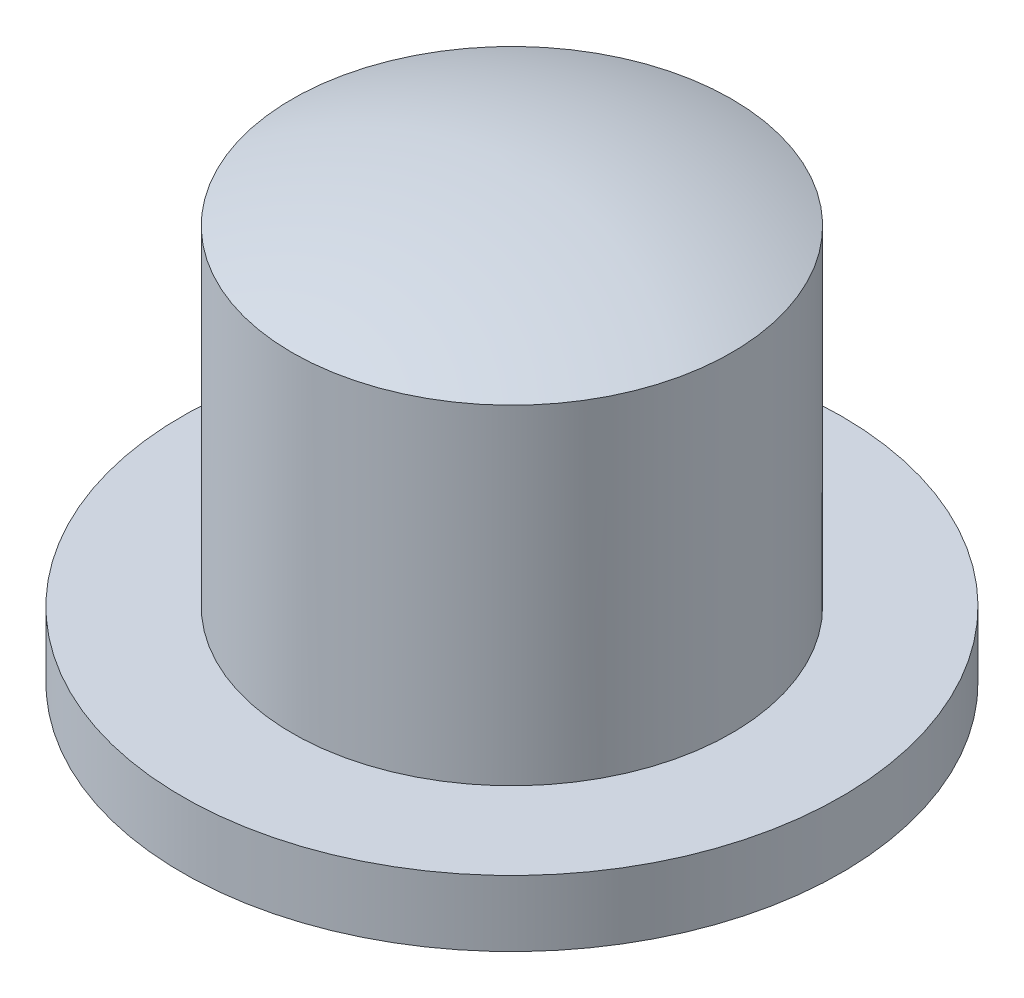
ISO-10303-21;
HEADER;
FILE_DESCRIPTION(('STEP AP214'),'2;1');
FILE_NAME('part.step','',(''),(''),'','','');
FILE_SCHEMA(('AUTOMOTIVE_DESIGN { 1 0 10303 214 1 1 1 1 }'));
ENDSEC;
DATA;
#1=APPLICATION_CONTEXT('core data for automotive mechanical design processes');
#2=APPLICATION_PROTOCOL_DEFINITION('international standard','automotive_design',2000,#1);
#3=PRODUCT_CONTEXT('',#1,'mechanical');
#4=PRODUCT('Part','Part','',(#3));
#5=PRODUCT_RELATED_PRODUCT_CATEGORY('part','',(#4));
#6=PRODUCT_DEFINITION_FORMATION('','',#4);
#7=PRODUCT_DEFINITION_CONTEXT('part definition',#1,'design');
#8=PRODUCT_DEFINITION('design','',#6,#7);
#9=PRODUCT_DEFINITION_SHAPE('','',#8);
#10=(LENGTH_UNIT() NAMED_UNIT(*) SI_UNIT(.MILLI.,.METRE.));
#11=(NAMED_UNIT(*) PLANE_ANGLE_UNIT() SI_UNIT($,.RADIAN.));
#12=(NAMED_UNIT(*) SI_UNIT($,.STERADIAN.) SOLID_ANGLE_UNIT());
#13=UNCERTAINTY_MEASURE_WITH_UNIT(LENGTH_MEASURE(1.E-05),#10,'distance_accuracy_value','');
#14=(GEOMETRIC_REPRESENTATION_CONTEXT(3) GLOBAL_UNCERTAINTY_ASSIGNED_CONTEXT((#13)) GLOBAL_UNIT_ASSIGNED_CONTEXT((#10,
#11,#12)) REPRESENTATION_CONTEXT('',''));
#15=CARTESIAN_POINT('',(0.,0.,0.));
#16=DIRECTION('',(0.,0.,1.));
#17=DIRECTION('',(1.,0.,0.));
#18=AXIS2_PLACEMENT_3D('',#15,#16,#17);
#19=CARTESIAN_POINT('',(0.,0.762,0.));
#20=DIRECTION('',(0.,1.,0.));
#21=DIRECTION('',(0.,0.,1.));
#22=AXIS2_PLACEMENT_3D('',#19,#20,#21);
#23=PLANE('',#22);
#24=CARTESIAN_POINT('',(0.,0.762,0.));
#25=DIRECTION('',(0.,1.,0.));
#26=DIRECTION('',(0.,0.,1.));
#27=AXIS2_PLACEMENT_3D('',#24,#25,#26);
#28=CIRCLE('',#27,3.81);
#29=CARTESIAN_POINT('',(0.,0.762,-3.81));
#30=VERTEX_POINT('',#29);
#31=EDGE_CURVE('E10',#30,#30,#28,.T.);
#32=ORIENTED_EDGE('',*,*,#31,.T.);
#33=EDGE_LOOP('',(#32));
#34=FACE_BOUND('',#33,.T.);
#35=CARTESIAN_POINT('',(0.,0.762,0.));
#36=DIRECTION('',(0.,1.,0.));
#37=DIRECTION('',(0.,0.,1.));
#38=AXIS2_PLACEMENT_3D('',#35,#36,#37);
#39=CIRCLE('',#38,2.54);
#40=CARTESIAN_POINT('',(0.,0.762,-2.54));
#41=VERTEX_POINT('',#40);
#42=EDGE_CURVE('E45',#41,#41,#39,.T.);
#43=ORIENTED_EDGE('',*,*,#42,.F.);
#44=EDGE_LOOP('',(#43));
#45=FACE_BOUND('',#44,.T.);
#46=ADVANCED_FACE('F31',(#34,#45),#23,.T.);
#47=CARTESIAN_POINT('',(0.,0.762,0.));
#48=DIRECTION('',(0.,-1.,0.));
#49=DIRECTION('',(0.,0.,-1.));
#50=AXIS2_PLACEMENT_3D('',#47,#48,#49);
#51=CYLINDRICAL_SURFACE('',#50,3.81);
#52=CARTESIAN_POINT('',(0.,0.,0.));
#53=DIRECTION('',(0.,1.,0.));
#54=DIRECTION('',(0.,0.,1.));
#55=AXIS2_PLACEMENT_3D('',#52,#53,#54);
#56=CIRCLE('',#55,3.81);
#57=CARTESIAN_POINT('',(0.,0.,-3.81));
#58=VERTEX_POINT('',#57);
#59=EDGE_CURVE('E39',#58,#58,#56,.T.);
#60=CARTESIAN_POINT('',(0.,0.762,-3.81));
#61=CARTESIAN_POINT('',(0.,0.7540625,-3.81));
#62=CARTESIAN_POINT('',(0.,0.746125,-3.81));
#63=CARTESIAN_POINT('',(0.,0.73025,-3.81));
#64=CARTESIAN_POINT('',(0.,0.7223125,-3.81));
#65=CARTESIAN_POINT('',(0.,0.7064375,-3.81));
#66=CARTESIAN_POINT('',(0.,0.6985,-3.81));
#67=CARTESIAN_POINT('',(0.,0.682625,-3.81));
#68=CARTESIAN_POINT('',(0.,0.6746875,-3.81));
#69=CARTESIAN_POINT('',(0.,0.6588125,-3.81));
#70=CARTESIAN_POINT('',(0.,0.650875,-3.81));
#71=CARTESIAN_POINT('',(0.,0.635,-3.81));
#72=CARTESIAN_POINT('',(0.,0.6270625,-3.81));
#73=CARTESIAN_POINT('',(0.,0.6111875,-3.81));
#74=CARTESIAN_POINT('',(0.,0.60325,-3.81));
#75=CARTESIAN_POINT('',(0.,0.587375,-3.81));
#76=CARTESIAN_POINT('',(0.,0.5794375,-3.81));
#77=CARTESIAN_POINT('',(0.,0.5635625,-3.81));
#78=CARTESIAN_POINT('',(0.,0.555625,-3.81));
#79=CARTESIAN_POINT('',(0.,0.53975,-3.81));
#80=CARTESIAN_POINT('',(0.,0.5318125,-3.81));
#81=CARTESIAN_POINT('',(0.,0.5159375,-3.81));
#82=CARTESIAN_POINT('',(0.,0.508,-3.81));
#83=CARTESIAN_POINT('',(0.,0.492125,-3.81));
#84=CARTESIAN_POINT('',(0.,0.4841875,-3.81));
#85=CARTESIAN_POINT('',(0.,0.4683125,-3.81));
#86=CARTESIAN_POINT('',(0.,0.460375,-3.81));
#87=CARTESIAN_POINT('',(0.,0.4445,-3.81));
#88=CARTESIAN_POINT('',(0.,0.4365625,-3.81));
#89=CARTESIAN_POINT('',(0.,0.4206875,-3.81));
#90=CARTESIAN_POINT('',(0.,0.41275,-3.81));
#91=CARTESIAN_POINT('',(0.,0.396875,-3.81));
#92=CARTESIAN_POINT('',(0.,0.3889375,-3.81));
#93=CARTESIAN_POINT('',(0.,0.3730625,-3.81));
#94=CARTESIAN_POINT('',(0.,0.365125,-3.81));
#95=CARTESIAN_POINT('',(0.,0.34925,-3.81));
#96=CARTESIAN_POINT('',(0.,0.3413125,-3.81));
#97=CARTESIAN_POINT('',(0.,0.3254375,-3.81));
#98=CARTESIAN_POINT('',(0.,0.3175,-3.81));
#99=CARTESIAN_POINT('',(0.,0.301625,-3.81));
#100=CARTESIAN_POINT('',(0.,0.2936875,-3.81));
#101=CARTESIAN_POINT('',(0.,0.2778125,-3.81));
#102=CARTESIAN_POINT('',(0.,0.269875,-3.81));
#103=CARTESIAN_POINT('',(0.,0.254,-3.81));
#104=CARTESIAN_POINT('',(0.,0.2460625,-3.81));
#105=CARTESIAN_POINT('',(0.,0.2301875,-3.81));
#106=CARTESIAN_POINT('',(0.,0.22225,-3.81));
#107=CARTESIAN_POINT('',(0.,0.206375,-3.81));
#108=CARTESIAN_POINT('',(0.,0.1984375,-3.81));
#109=CARTESIAN_POINT('',(0.,0.1825625,-3.81));
#110=CARTESIAN_POINT('',(0.,0.174625,-3.81));
#111=CARTESIAN_POINT('',(0.,0.15875,-3.81));
#112=CARTESIAN_POINT('',(0.,0.1508125,-3.81));
#113=CARTESIAN_POINT('',(0.,0.1349375,-3.81));
#114=CARTESIAN_POINT('',(0.,0.127,-3.81));
#115=CARTESIAN_POINT('',(0.,0.111125,-3.81));
#116=CARTESIAN_POINT('',(0.,0.1031875,-3.81));
#117=CARTESIAN_POINT('',(0.,0.0873125,-3.81));
#118=CARTESIAN_POINT('',(0.,0.079375,-3.81));
#119=CARTESIAN_POINT('',(0.,0.0635,-3.81));
#120=CARTESIAN_POINT('',(0.,0.0555625,-3.81));
#121=CARTESIAN_POINT('',(0.,0.0396875,-3.81));
#122=CARTESIAN_POINT('',(0.,0.03175,-3.81));
#123=CARTESIAN_POINT('',(0.,0.015875,-3.81));
#124=CARTESIAN_POINT('',(0.,0.00793749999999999,-3.81));
#125=CARTESIAN_POINT('',(0.,0.,-3.81));
#126=B_SPLINE_CURVE_WITH_KNOTS('',3,(#60,#61,#62,#63,#64,#65,#66,#67,#68,#69,#70,#71,#72,#73,
#74,#75,#76,#77,#78,#79,#80,#81,#82,#83,#84,#85,#86,#87,#88,#89,#90,#91,#92,#93,#94,#95,#96,#97,
#98,#99,#100,#101,#102,#103,#104,#105,#106,#107,#108,#109,#110,#111,#112,#113,#114,#115,#116,
#117,#118,#119,#120,#121,#122,#123,#124,#125),.UNSPECIFIED.,.F.,.F.,(4,2,2,2,2,2,2,2,2,2,2,2,2,
2,2,2,2,2,2,2,2,2,2,2,2,2,2,2,2,2,2,2,4),(0.,0.0238125,0.0476249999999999,0.0714374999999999,
0.09525,0.1190625,0.142875,0.1666875,0.1905,0.2143125,0.238125,0.2619375,0.28575,0.3095625,
0.333375,0.3571875,0.381,0.4048125,0.428625,0.4524375,0.47625,0.5000625,0.523875,0.5476875,
0.5715,0.5953125,0.619125,0.6429375,0.66675,0.6905625,0.714375,0.7381875,0.762),.UNSPECIFIED.);
#127=EDGE_CURVE('BSEAM61',#30,#58,#126,.T.);
#128=ORIENTED_EDGE('',*,*,#31,.F.);
#129=ORIENTED_EDGE('',*,*,#59,.T.);
#130=ORIENTED_EDGE('',*,*,#127,.T.);
#131=ORIENTED_EDGE('',*,*,#127,.F.);
#132=EDGE_LOOP('',(#128,#130,#129,#131));
#133=FACE_BOUND('',#132,.T.);
#134=ADVANCED_FACE('F61',(#133),#51,.T.);
#135=CARTESIAN_POINT('',(0.,0.,0.));
#136=DIRECTION('',(0.,1.,0.));
#137=DIRECTION('',(0.,0.,1.));
#138=AXIS2_PLACEMENT_3D('',#135,#136,#137);
#139=PLANE('',#138);
#140=ORIENTED_EDGE('',*,*,#59,.F.);
#141=EDGE_LOOP('',(#140));
#142=FACE_BOUND('',#141,.T.);
#143=ADVANCED_FACE('F55',(#142),#139,.F.);
#144=CARTESIAN_POINT('',(0.,4.572,0.));
#145=DIRECTION('',(0.,-1.,0.));
#146=DIRECTION('',(0.,0.,-1.));
#147=AXIS2_PLACEMENT_3D('',#144,#145,#146);
#148=CYLINDRICAL_SURFACE('',#147,2.54);
#149=CARTESIAN_POINT('',(0.,4.572,0.));
#150=DIRECTION('',(0.,1.,0.));
#151=DIRECTION('',(0.,0.,1.));
#152=AXIS2_PLACEMENT_3D('',#149,#150,#151);
#153=CIRCLE('',#152,2.54);
#154=CARTESIAN_POINT('',(0.,4.572,-2.54));
#155=VERTEX_POINT('',#154);
#156=EDGE_CURVE('E35',#155,#155,#153,.T.);
#157=CARTESIAN_POINT('',(0.,4.572,-2.54));
#158=CARTESIAN_POINT('',(0.,4.5323125,-2.54));
#159=CARTESIAN_POINT('',(0.,4.492625,-2.54));
#160=CARTESIAN_POINT('',(0.,4.41325,-2.54));
#161=CARTESIAN_POINT('',(0.,4.3735625,-2.54));
#162=CARTESIAN_POINT('',(0.,4.2941875,-2.54));
#163=CARTESIAN_POINT('',(0.,4.2545,-2.54));
#164=CARTESIAN_POINT('',(0.,4.175125,-2.54));
#165=CARTESIAN_POINT('',(0.,4.1354375,-2.54));
#166=CARTESIAN_POINT('',(0.,4.0560625,-2.54));
#167=CARTESIAN_POINT('',(0.,4.016375,-2.54));
#168=CARTESIAN_POINT('',(0.,3.937,-2.54));
#169=CARTESIAN_POINT('',(0.,3.8973125,-2.54));
#170=CARTESIAN_POINT('',(0.,3.8179375,-2.54));
#171=CARTESIAN_POINT('',(0.,3.77825,-2.54));
#172=CARTESIAN_POINT('',(0.,3.698875,-2.54));
#173=CARTESIAN_POINT('',(0.,3.6591875,-2.54));
#174=CARTESIAN_POINT('',(0.,3.5798125,-2.54));
#175=CARTESIAN_POINT('',(0.,3.540125,-2.54));
#176=CARTESIAN_POINT('',(0.,3.46075,-2.54));
#177=CARTESIAN_POINT('',(0.,3.4210625,-2.54));
#178=CARTESIAN_POINT('',(0.,3.3416875,-2.54));
#179=CARTESIAN_POINT('',(0.,3.302,-2.54));
#180=CARTESIAN_POINT('',(0.,3.222625,-2.54));
#181=CARTESIAN_POINT('',(0.,3.1829375,-2.54));
#182=CARTESIAN_POINT('',(0.,3.1035625,-2.54));
#183=CARTESIAN_POINT('',(0.,3.063875,-2.54));
#184=CARTESIAN_POINT('',(0.,2.9845,-2.54));
#185=CARTESIAN_POINT('',(0.,2.9448125,-2.54));
#186=CARTESIAN_POINT('',(0.,2.8654375,-2.54));
#187=CARTESIAN_POINT('',(0.,2.82575,-2.54));
#188=CARTESIAN_POINT('',(0.,2.746375,-2.54));
#189=CARTESIAN_POINT('',(0.,2.7066875,-2.54));
#190=CARTESIAN_POINT('',(0.,2.6273125,-2.54));
#191=CARTESIAN_POINT('',(0.,2.587625,-2.54));
#192=CARTESIAN_POINT('',(0.,2.50825,-2.54));
#193=CARTESIAN_POINT('',(0.,2.4685625,-2.54));
#194=CARTESIAN_POINT('',(0.,2.3891875,-2.54));
#195=CARTESIAN_POINT('',(0.,2.3495,-2.54));
#196=CARTESIAN_POINT('',(0.,2.270125,-2.54));
#197=CARTESIAN_POINT('',(0.,2.2304375,-2.54));
#198=CARTESIAN_POINT('',(0.,2.1510625,-2.54));
#199=CARTESIAN_POINT('',(0.,2.111375,-2.54));
#200=CARTESIAN_POINT('',(0.,2.032,-2.54));
#201=CARTESIAN_POINT('',(0.,1.9923125,-2.54));
#202=CARTESIAN_POINT('',(0.,1.9129375,-2.54));
#203=CARTESIAN_POINT('',(0.,1.87325,-2.54));
#204=CARTESIAN_POINT('',(0.,1.793875,-2.54));
#205=CARTESIAN_POINT('',(0.,1.7541875,-2.54));
#206=CARTESIAN_POINT('',(0.,1.6748125,-2.54));
#207=CARTESIAN_POINT('',(0.,1.635125,-2.54));
#208=CARTESIAN_POINT('',(0.,1.55575,-2.54));
#209=CARTESIAN_POINT('',(0.,1.5160625,-2.54));
#210=CARTESIAN_POINT('',(0.,1.4366875,-2.54));
#211=CARTESIAN_POINT('',(0.,1.397,-2.54));
#212=CARTESIAN_POINT('',(0.,1.317625,-2.54));
#213=CARTESIAN_POINT('',(0.,1.2779375,-2.54));
#214=CARTESIAN_POINT('',(0.,1.1985625,-2.54));
#215=CARTESIAN_POINT('',(0.,1.158875,-2.54));
#216=CARTESIAN_POINT('',(0.,1.0795,-2.54));
#217=CARTESIAN_POINT('',(0.,1.0398125,-2.54));
#218=CARTESIAN_POINT('',(0.,0.9604375,-2.54));
#219=CARTESIAN_POINT('',(0.,0.92075,-2.54));
#220=CARTESIAN_POINT('',(0.,0.841375,-2.54));
#221=CARTESIAN_POINT('',(0.,0.8016875,-2.54));
#222=CARTESIAN_POINT('',(0.,0.762,-2.54));
#223=B_SPLINE_CURVE_WITH_KNOTS('',3,(#157,#158,#159,#160,#161,#162,#163,#164,#165,#166,#167,
#168,#169,#170,#171,#172,#173,#174,#175,#176,#177,#178,#179,#180,#181,#182,#183,#184,#185,#186,
#187,#188,#189,#190,#191,#192,#193,#194,#195,#196,#197,#198,#199,#200,#201,#202,#203,#204,#205,
#206,#207,#208,#209,#210,#211,#212,#213,#214,#215,#216,#217,#218,#219,#220,#221,#222),
.UNSPECIFIED.,.F.,.F.,(4,2,2,2,2,2,2,2,2,2,2,2,2,2,2,2,2,2,2,2,2,2,2,2,2,2,2,2,2,2,2,2,4),(0.,
0.1190625,0.238125,0.357187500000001,0.47625,0.5953125,0.714375,0.8334375,0.9525,1.0715625,
1.190625,1.3096875,1.42875,1.5478125,1.666875,1.7859375,1.905,2.0240625,2.143125,2.2621875,
2.38125,2.5003125,2.619375,2.7384375,2.8575,2.9765625,3.095625,3.2146875,3.33375,3.4528125,
3.571875,3.6909375,3.81),.UNSPECIFIED.);
#224=EDGE_CURVE('BSEAM53',#155,#41,#223,.T.);
#225=ORIENTED_EDGE('',*,*,#156,.F.);
#226=ORIENTED_EDGE('',*,*,#42,.T.);
#227=ORIENTED_EDGE('',*,*,#224,.T.);
#228=ORIENTED_EDGE('',*,*,#224,.F.);
#229=EDGE_LOOP('',(#225,#227,#226,#228));
#230=FACE_BOUND('',#229,.T.);
#231=ADVANCED_FACE('F53',(#230),#148,.T.);
#232=CARTESIAN_POINT('',(0.,-1.524,0.));
#233=DIRECTION('',(0.,0.,1.));
#234=DIRECTION('',(1.,0.,0.));
#235=AXIS2_PLACEMENT_3D('',#232,#233,#234);
#236=SPHERICAL_SURFACE('',#235,6.604);
#237=CARTESIAN_POINT('',(0.,-1.524,0.));
#238=DIRECTION('',(0.,1.,0.));
#239=DIRECTION('',(0.,0.,1.));
#240=AXIS2_PLACEMENT_3D('',#237,#238,#239);
#241=SPHERICAL_SURFACE('',#240,6.604);
#242=ORIENTED_EDGE('',*,*,#156,.T.);
#243=EDGE_LOOP('',(#242));
#244=FACE_BOUND('',#243,.T.);
#245=ADVANCED_FACE('F33',(#244),#241,.T.);
#246=CLOSED_SHELL('',(#46,#134,#143,#231,#245));
#247=MANIFOLD_SOLID_BREP('B2',#246);
#248=ADVANCED_BREP_SHAPE_REPRESENTATION('',(#18,#247),#14);
#249=SHAPE_DEFINITION_REPRESENTATION(#9,#248);
ENDSEC;
END-ISO-10303-21;
